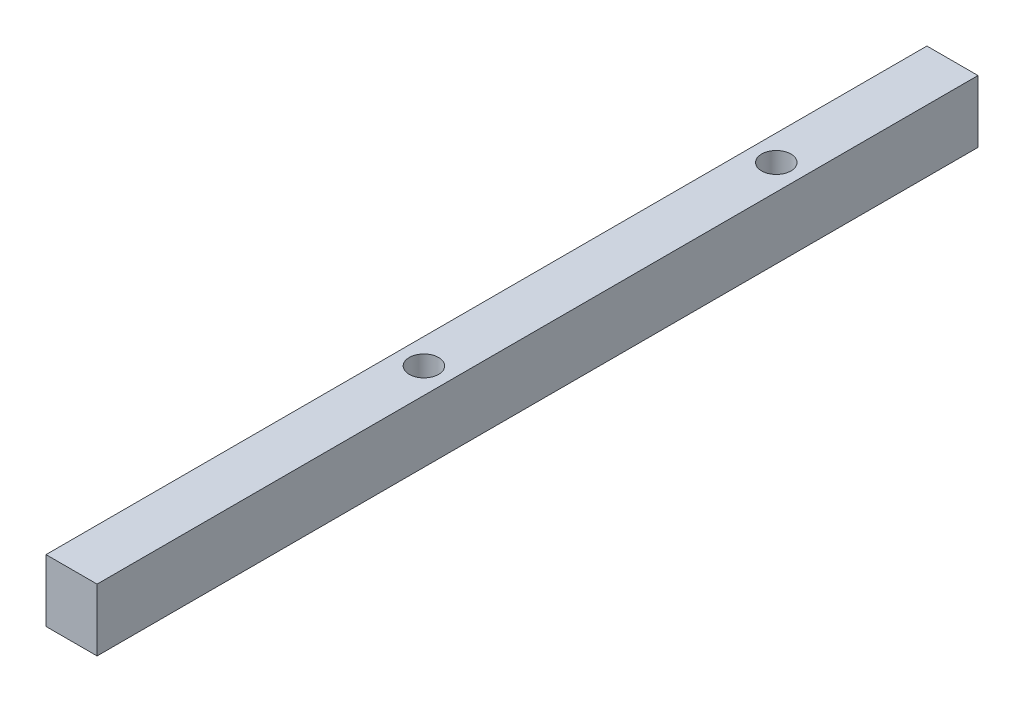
ISO-10303-21;
HEADER;
FILE_DESCRIPTION(('STEP AP214'),'2;1');
FILE_NAME('part.step','',(''),(''),'','','');
FILE_SCHEMA(('AUTOMOTIVE_DESIGN { 1 0 10303 214 1 1 1 1 }'));
ENDSEC;
DATA;
#1=APPLICATION_CONTEXT('core data for automotive mechanical design processes');
#2=APPLICATION_PROTOCOL_DEFINITION('international standard','automotive_design',2000,#1);
#3=PRODUCT_CONTEXT('',#1,'mechanical');
#4=PRODUCT('Part','Part','',(#3));
#5=PRODUCT_RELATED_PRODUCT_CATEGORY('part','',(#4));
#6=PRODUCT_DEFINITION_FORMATION('','',#4);
#7=PRODUCT_DEFINITION_CONTEXT('part definition',#1,'design');
#8=PRODUCT_DEFINITION('design','',#6,#7);
#9=PRODUCT_DEFINITION_SHAPE('','',#8);
#10=(LENGTH_UNIT() NAMED_UNIT(*) SI_UNIT(.MILLI.,.METRE.));
#11=(NAMED_UNIT(*) PLANE_ANGLE_UNIT() SI_UNIT($,.RADIAN.));
#12=(NAMED_UNIT(*) SI_UNIT($,.STERADIAN.) SOLID_ANGLE_UNIT());
#13=UNCERTAINTY_MEASURE_WITH_UNIT(LENGTH_MEASURE(1.E-05),#10,'distance_accuracy_value','');
#14=(GEOMETRIC_REPRESENTATION_CONTEXT(3) GLOBAL_UNCERTAINTY_ASSIGNED_CONTEXT((#13)) GLOBAL_UNIT_ASSIGNED_CONTEXT((#10,
#11,#12)) REPRESENTATION_CONTEXT('',''));
#15=CARTESIAN_POINT('',(0.,0.,0.));
#16=DIRECTION('',(0.,0.,1.));
#17=DIRECTION('',(1.,0.,0.));
#18=AXIS2_PLACEMENT_3D('',#15,#16,#17);
#19=CARTESIAN_POINT('',(0.,10.6,0.));
#20=DIRECTION('',(0.,0.,-1.));
#21=DIRECTION('',(-1.,0.,0.));
#22=AXIS2_PLACEMENT_3D('',#19,#20,#21);
#23=PLANE('',#22);
#24=DIRECTION('',(1.,0.,0.));
#25=VECTOR('',#24,1.);
#26=CARTESIAN_POINT('',(0.,0.,0.));
#27=LINE('',#26,#25);
#28=CARTESIAN_POINT('',(0.,0.,0.));
#29=VERTEX_POINT('',#28);
#30=CARTESIAN_POINT('',(8.7,0.,0.));
#31=VERTEX_POINT('',#30);
#32=EDGE_CURVE('E104',#29,#31,#27,.T.);
#33=ORIENTED_EDGE('',*,*,#32,.T.);
#34=DIRECTION('',(0.,-1.,0.));
#35=VECTOR('',#34,1.);
#36=CARTESIAN_POINT('',(8.7,10.6,0.));
#37=LINE('',#36,#35);
#38=CARTESIAN_POINT('',(8.7,10.6,0.));
#39=VERTEX_POINT('',#38);
#40=EDGE_CURVE('E11',#39,#31,#37,.T.);
#41=ORIENTED_EDGE('',*,*,#40,.F.);
#42=DIRECTION('',(1.,0.,0.));
#43=VECTOR('',#42,1.);
#44=CARTESIAN_POINT('',(0.,10.6,0.));
#45=LINE('',#44,#43);
#46=CARTESIAN_POINT('',(0.,10.6,0.));
#47=VERTEX_POINT('',#46);
#48=EDGE_CURVE('E84',#47,#39,#45,.T.);
#49=ORIENTED_EDGE('',*,*,#48,.F.);
#50=DIRECTION('',(0.,-1.,0.));
#51=VECTOR('',#50,1.);
#52=CARTESIAN_POINT('',(0.,10.6,0.));
#53=LINE('',#52,#51);
#54=EDGE_CURVE('E51',#47,#29,#53,.T.);
#55=ORIENTED_EDGE('',*,*,#54,.T.);
#56=EDGE_LOOP('',(#33,#41,#49,#55));
#57=FACE_BOUND('',#56,.T.);
#58=ADVANCED_FACE('F34',(#57),#23,.F.);
#59=CARTESIAN_POINT('',(8.7,10.6,0.));
#60=DIRECTION('',(-1.,0.,0.));
#61=DIRECTION('',(0.,0.,1.));
#62=AXIS2_PLACEMENT_3D('',#59,#60,#61);
#63=PLANE('',#62);
#64=DIRECTION('',(0.,0.,-1.));
#65=VECTOR('',#64,1.);
#66=CARTESIAN_POINT('',(8.7,0.,0.));
#67=LINE('',#66,#65);
#68=CARTESIAN_POINT('',(8.7,0.,-150.));
#69=VERTEX_POINT('',#68);
#70=EDGE_CURVE('E89',#31,#69,#67,.T.);
#71=ORIENTED_EDGE('',*,*,#70,.T.);
#72=DIRECTION('',(0.,-1.,0.));
#73=VECTOR('',#72,1.);
#74=CARTESIAN_POINT('',(8.7,10.6,-150.));
#75=LINE('',#74,#73);
#76=CARTESIAN_POINT('',(8.7,10.6,-150.));
#77=VERTEX_POINT('',#76);
#78=EDGE_CURVE('E43',#77,#69,#75,.T.);
#79=ORIENTED_EDGE('',*,*,#78,.F.);
#80=DIRECTION('',(0.,0.,-1.));
#81=VECTOR('',#80,1.);
#82=CARTESIAN_POINT('',(8.7,10.6,0.));
#83=LINE('',#82,#81);
#84=EDGE_CURVE('E76',#39,#77,#83,.T.);
#85=ORIENTED_EDGE('',*,*,#84,.F.);
#86=ORIENTED_EDGE('',*,*,#40,.T.);
#87=EDGE_LOOP('',(#71,#79,#85,#86));
#88=FACE_BOUND('',#87,.T.);
#89=ADVANCED_FACE('F88',(#88),#63,.F.);
#90=CARTESIAN_POINT('',(0.,10.6,-150.));
#91=DIRECTION('',(0.,0.,-1.));
#92=DIRECTION('',(-1.,0.,0.));
#93=AXIS2_PLACEMENT_3D('',#90,#91,#92);
#94=PLANE('',#93);
#95=DIRECTION('',(1.,0.,0.));
#96=VECTOR('',#95,1.);
#97=CARTESIAN_POINT('',(0.,0.,-150.));
#98=LINE('',#97,#96);
#99=CARTESIAN_POINT('',(0.,0.,-150.));
#100=VERTEX_POINT('',#99);
#101=EDGE_CURVE('E107',#100,#69,#98,.T.);
#102=ORIENTED_EDGE('',*,*,#101,.F.);
#103=DIRECTION('',(0.,-1.,0.));
#104=VECTOR('',#103,1.);
#105=CARTESIAN_POINT('',(0.,10.6,-150.));
#106=LINE('',#105,#104);
#107=CARTESIAN_POINT('',(0.,10.6,-150.));
#108=VERTEX_POINT('',#107);
#109=EDGE_CURVE('E65',#108,#100,#106,.T.);
#110=ORIENTED_EDGE('',*,*,#109,.F.);
#111=DIRECTION('',(1.,0.,0.));
#112=VECTOR('',#111,1.);
#113=CARTESIAN_POINT('',(0.,10.6,-150.));
#114=LINE('',#113,#112);
#115=EDGE_CURVE('E83',#108,#77,#114,.T.);
#116=ORIENTED_EDGE('',*,*,#115,.T.);
#117=ORIENTED_EDGE('',*,*,#78,.T.);
#118=EDGE_LOOP('',(#102,#110,#116,#117));
#119=FACE_BOUND('',#118,.T.);
#120=ADVANCED_FACE('F92',(#119),#94,.T.);
#121=CARTESIAN_POINT('',(4.35,10.6,-120.));
#122=DIRECTION('',(0.,-1.,0.));
#123=DIRECTION('',(0.,0.,-1.));
#124=AXIS2_PLACEMENT_3D('',#121,#122,#123);
#125=CYLINDRICAL_SURFACE('',#124,2.5);
#126=CARTESIAN_POINT('',(4.35,10.6,-120.));
#127=DIRECTION('',(0.,1.,0.));
#128=DIRECTION('',(0.,0.,1.));
#129=AXIS2_PLACEMENT_3D('',#126,#127,#128);
#130=CIRCLE('',#129,2.5);
#131=CARTESIAN_POINT('',(4.35,10.6,-117.5));
#132=VERTEX_POINT('',#131);
#133=EDGE_CURVE('E116',#132,#132,#130,.T.);
#134=ORIENTED_EDGE('',*,*,#133,.T.);
#135=EDGE_LOOP('',(#134));
#136=FACE_BOUND('',#135,.T.);
#137=CARTESIAN_POINT('',(4.35,0.,-120.));
#138=DIRECTION('',(0.,1.,0.));
#139=DIRECTION('',(0.,0.,1.));
#140=AXIS2_PLACEMENT_3D('',#137,#138,#139);
#141=CIRCLE('',#140,2.5);
#142=CARTESIAN_POINT('',(4.35,0.,-117.5));
#143=VERTEX_POINT('',#142);
#144=EDGE_CURVE('E101',#143,#143,#141,.T.);
#145=ORIENTED_EDGE('',*,*,#144,.F.);
#146=EDGE_LOOP('',(#145));
#147=FACE_BOUND('',#146,.T.);
#148=ADVANCED_FACE('F124',(#136,#147),#125,.F.);
#149=CARTESIAN_POINT('',(4.35,10.6,-60.));
#150=DIRECTION('',(0.,-1.,0.));
#151=DIRECTION('',(0.,0.,-1.));
#152=AXIS2_PLACEMENT_3D('',#149,#150,#151);
#153=CYLINDRICAL_SURFACE('',#152,2.5);
#154=CARTESIAN_POINT('',(4.35,10.6,-60.));
#155=DIRECTION('',(0.,1.,0.));
#156=DIRECTION('',(0.,0.,1.));
#157=AXIS2_PLACEMENT_3D('',#154,#155,#156);
#158=CIRCLE('',#157,2.5);
#159=CARTESIAN_POINT('',(4.35,10.6,-57.5));
#160=VERTEX_POINT('',#159);
#161=EDGE_CURVE('E112',#160,#160,#158,.T.);
#162=ORIENTED_EDGE('',*,*,#161,.T.);
#163=EDGE_LOOP('',(#162));
#164=FACE_BOUND('',#163,.T.);
#165=CARTESIAN_POINT('',(4.35,0.,-60.));
#166=DIRECTION('',(0.,1.,0.));
#167=DIRECTION('',(0.,0.,1.));
#168=AXIS2_PLACEMENT_3D('',#165,#166,#167);
#169=CIRCLE('',#168,2.5);
#170=CARTESIAN_POINT('',(4.35,0.,-57.5));
#171=VERTEX_POINT('',#170);
#172=EDGE_CURVE('E98',#171,#171,#169,.T.);
#173=ORIENTED_EDGE('',*,*,#172,.F.);
#174=EDGE_LOOP('',(#173));
#175=FACE_BOUND('',#174,.T.);
#176=ADVANCED_FACE('F36',(#164,#175),#153,.F.);
#177=CARTESIAN_POINT('',(0.,10.6,0.));
#178=DIRECTION('',(-1.,0.,0.));
#179=DIRECTION('',(0.,0.,1.));
#180=AXIS2_PLACEMENT_3D('',#177,#178,#179);
#181=PLANE('',#180);
#182=DIRECTION('',(0.,0.,-1.));
#183=VECTOR('',#182,1.);
#184=CARTESIAN_POINT('',(0.,0.,0.));
#185=LINE('',#184,#183);
#186=EDGE_CURVE('E109',#29,#100,#185,.T.);
#187=ORIENTED_EDGE('',*,*,#186,.F.);
#188=ORIENTED_EDGE('',*,*,#54,.F.);
#189=DIRECTION('',(0.,0.,-1.));
#190=VECTOR('',#189,1.);
#191=CARTESIAN_POINT('',(0.,10.6,0.));
#192=LINE('',#191,#190);
#193=EDGE_CURVE('E93',#47,#108,#192,.T.);
#194=ORIENTED_EDGE('',*,*,#193,.T.);
#195=ORIENTED_EDGE('',*,*,#109,.T.);
#196=EDGE_LOOP('',(#187,#188,#194,#195));
#197=FACE_BOUND('',#196,.T.);
#198=ADVANCED_FACE('F129',(#197),#181,.T.);
#199=CARTESIAN_POINT('',(0.,10.6,0.));
#200=DIRECTION('',(0.,1.,0.));
#201=DIRECTION('',(0.,0.,1.));
#202=AXIS2_PLACEMENT_3D('',#199,#200,#201);
#203=PLANE('',#202);
#204=ORIENTED_EDGE('',*,*,#161,.F.);
#205=EDGE_LOOP('',(#204));
#206=FACE_BOUND('',#205,.T.);
#207=ORIENTED_EDGE('',*,*,#133,.F.);
#208=EDGE_LOOP('',(#207));
#209=FACE_BOUND('',#208,.T.);
#210=ORIENTED_EDGE('',*,*,#48,.T.);
#211=ORIENTED_EDGE('',*,*,#84,.T.);
#212=ORIENTED_EDGE('',*,*,#115,.F.);
#213=ORIENTED_EDGE('',*,*,#193,.F.);
#214=EDGE_LOOP('',(#210,#211,#212,#213));
#215=FACE_BOUND('',#214,.T.);
#216=ADVANCED_FACE('F80',(#206,#209,#215),#203,.T.);
#217=CARTESIAN_POINT('',(0.,0.,0.));
#218=DIRECTION('',(0.,1.,0.));
#219=DIRECTION('',(0.,0.,1.));
#220=AXIS2_PLACEMENT_3D('',#217,#218,#219);
#221=PLANE('',#220);
#222=ORIENTED_EDGE('',*,*,#172,.T.);
#223=EDGE_LOOP('',(#222));
#224=FACE_BOUND('',#223,.T.);
#225=ORIENTED_EDGE('',*,*,#144,.T.);
#226=EDGE_LOOP('',(#225));
#227=FACE_BOUND('',#226,.T.);
#228=ORIENTED_EDGE('',*,*,#32,.F.);
#229=ORIENTED_EDGE('',*,*,#186,.T.);
#230=ORIENTED_EDGE('',*,*,#101,.T.);
#231=ORIENTED_EDGE('',*,*,#70,.F.);
#232=EDGE_LOOP('',(#228,#229,#230,#231));
#233=FACE_BOUND('',#232,.T.);
#234=ADVANCED_FACE('F128',(#224,#227,#233),#221,.F.);
#235=CLOSED_SHELL('',(#58,#89,#120,#148,#176,#198,#216,#234));
#236=MANIFOLD_SOLID_BREP('B2',#235);
#237=ADVANCED_BREP_SHAPE_REPRESENTATION('',(#18,#236),#14);
#238=SHAPE_DEFINITION_REPRESENTATION(#9,#237);
ENDSEC;
END-ISO-10303-21;
